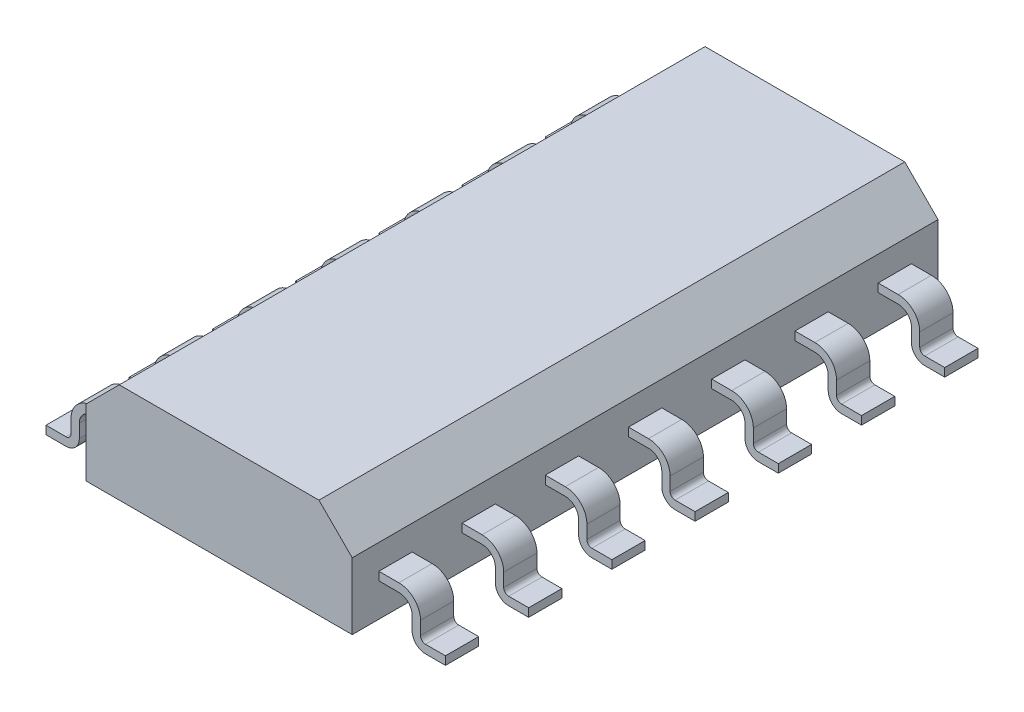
from build123d import *

# Parameters (mm, degrees)
EXTRUDE1_DEPTH       = 4.4
EXTRUDE2_DEPTH       = 0.5
LPATTERN1_COUNT      = 7
LPATTERN1_PITCH      = 1.25
MIRROR1_COPY_1_DEPTH = 0.5
MIRROR1_COPY_2_DEPTH = 0.5
MIRROR1_COPY_3_DEPTH = 0.5
MIRROR1_COPY_4_DEPTH = 0.5
MIRROR1_COPY_5_DEPTH = 0.5
MIRROR1_COPY_6_DEPTH = 0.5


with BuildPart() as part:
    # Sketch1 → Extrude1 (new, symmetric)
    with BuildSketch(Plane.XY):
        Polygon((-2, -0.75), (2, -0.75), (2, 0.25), (1.5, 0.75), (-1.5, 0.75), (-2, 0.25), align=None)
    extrude(amount=EXTRUDE1_DEPTH, both=True)

    # Sketch2 → Extrude2 (add)
    with BuildSketch(Plane.XY.offset(4)):
        with BuildLine():
            Line((-2.5, -0.65), (-2.5, -0.45))
            ThreePointArc((-2.5, -0.45), (-2.441421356, -0.308578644), (-2.3, -0.25))
            Line((-2.3, -0.25), (-2, -0.25))
            Line((-2, -0.25), (-2, -0.125))
            Line((-2, -0.125), (-2.3, -0.125))
            ThreePointArc((-2.3, -0.125), (-2.529809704, -0.220190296), (-2.625, -0.45))
            Line((-2.625, -0.45), (-2.625, -0.65))
            ThreePointArc((-2.625, -0.65), (-2.646966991, -0.703033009), (-2.7, -0.725))
            Line((-2.7, -0.725), (-3, -0.725))
            Line((-3, -0.725), (-3, -0.85))
            Line((-3, -0.85), (-2.7, -0.85))
            ThreePointArc((-2.7, -0.85), (-2.558578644, -0.791421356), (-2.5, -0.65))
        make_face()
    extrude2 = extrude(amount=-EXTRUDE2_DEPTH)

    # LPattern1: Extrude2 ×7
    with Locations(*[(0, 0, -i * LPATTERN1_PITCH) for i in range(1, LPATTERN1_COUNT)]):
        add(extrude2)

    # Mirror1: Extrude2 across plane
    add(extrude2.mirror(Plane(origin=(0, 0, 0), x_dir=(0, 0, 1), z_dir=(1, 0, 0))))

    # Mirror1 copy 1 sketch → Mirror1 copy 1 (add)
    with BuildSketch(Plane(origin=(0, 0, 2.75), x_dir=(-1, 0, 0), z_dir=(0, 0, 1))):
        with BuildLine():
            Line((-2.5, 0.65), (-2.5, 0.45))
            ThreePointArc((-2.5, 0.45), (-2.441421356, 0.308578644), (-2.3, 0.25))
            Line((-2.3, 0.25), (-2, 0.25))
            Line((-2, 0.25), (-2, 0.125))
            Line((-2, 0.125), (-2.3, 0.125))
            ThreePointArc((-2.3, 0.125), (-2.529809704, 0.220190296), (-2.625, 0.45))
            Line((-2.625, 0.45), (-2.625, 0.65))
            ThreePointArc((-2.625, 0.65), (-2.646966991, 0.703033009), (-2.7, 0.725))
            Line((-2.7, 0.725), (-3, 0.725))
            Line((-3, 0.725), (-3, 0.85))
            Line((-3, 0.85), (-2.7, 0.85))
            ThreePointArc((-2.7, 0.85), (-2.558578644, 0.791421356), (-2.5, 0.65))
        make_face()
    extrude(amount=-MIRROR1_COPY_1_DEPTH)

    # Mirror1 copy 2 sketch → Mirror1 copy 2 (add)
    with BuildSketch(Plane(origin=(0, 0, 1.5), x_dir=(-1, 0, 0), z_dir=(0, 0, 1))):
        with BuildLine():
            Line((-2.5, 0.65), (-2.5, 0.45))
            ThreePointArc((-2.5, 0.45), (-2.441421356, 0.308578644), (-2.3, 0.25))
            Line((-2.3, 0.25), (-2, 0.25))
            Line((-2, 0.25), (-2, 0.125))
            Line((-2, 0.125), (-2.3, 0.125))
            ThreePointArc((-2.3, 0.125), (-2.529809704, 0.220190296), (-2.625, 0.45))
            Line((-2.625, 0.45), (-2.625, 0.65))
            ThreePointArc((-2.625, 0.65), (-2.646966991, 0.703033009), (-2.7, 0.725))
            Line((-2.7, 0.725), (-3, 0.725))
            Line((-3, 0.725), (-3, 0.85))
            Line((-3, 0.85), (-2.7, 0.85))
            ThreePointArc((-2.7, 0.85), (-2.558578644, 0.791421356), (-2.5, 0.65))
        make_face()
    extrude(amount=-MIRROR1_COPY_2_DEPTH)

    # Mirror1 copy 3 sketch → Mirror1 copy 3 (add)
    with BuildSketch(Plane(origin=(0, 0, 0.25), x_dir=(-1, 0, 0), z_dir=(0, 0, 1))):
        with BuildLine():
            Line((-2.5, 0.65), (-2.5, 0.45))
            ThreePointArc((-2.5, 0.45), (-2.441421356, 0.308578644), (-2.3, 0.25))
            Line((-2.3, 0.25), (-2, 0.25))
            Line((-2, 0.25), (-2, 0.125))
            Line((-2, 0.125), (-2.3, 0.125))
            ThreePointArc((-2.3, 0.125), (-2.529809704, 0.220190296), (-2.625, 0.45))
            Line((-2.625, 0.45), (-2.625, 0.65))
            ThreePointArc((-2.625, 0.65), (-2.646966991, 0.703033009), (-2.7, 0.725))
            Line((-2.7, 0.725), (-3, 0.725))
            Line((-3, 0.725), (-3, 0.85))
            Line((-3, 0.85), (-2.7, 0.85))
            ThreePointArc((-2.7, 0.85), (-2.558578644, 0.791421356), (-2.5, 0.65))
        make_face()
    extrude(amount=-MIRROR1_COPY_3_DEPTH)

    # Mirror1 copy 4 sketch → Mirror1 copy 4 (add)
    with BuildSketch(Plane(origin=(0, 0, -1), x_dir=(-1, 0, 0), z_dir=(0, 0, 1))):
        with BuildLine():
            Line((-2.5, 0.65), (-2.5, 0.45))
            ThreePointArc((-2.5, 0.45), (-2.441421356, 0.308578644), (-2.3, 0.25))
            Line((-2.3, 0.25), (-2, 0.25))
            Line((-2, 0.25), (-2, 0.125))
            Line((-2, 0.125), (-2.3, 0.125))
            ThreePointArc((-2.3, 0.125), (-2.529809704, 0.220190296), (-2.625, 0.45))
            Line((-2.625, 0.45), (-2.625, 0.65))
            ThreePointArc((-2.625, 0.65), (-2.646966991, 0.703033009), (-2.7, 0.725))
            Line((-2.7, 0.725), (-3, 0.725))
            Line((-3, 0.725), (-3, 0.85))
            Line((-3, 0.85), (-2.7, 0.85))
            ThreePointArc((-2.7, 0.85), (-2.558578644, 0.791421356), (-2.5, 0.65))
        make_face()
    extrude(amount=-MIRROR1_COPY_4_DEPTH)

    # Mirror1 copy 5 sketch → Mirror1 copy 5 (add)
    with BuildSketch(Plane(origin=(0, 0, -2.25), x_dir=(-1, 0, 0), z_dir=(0, 0, 1))):
        with BuildLine():
            Line((-2.5, 0.65), (-2.5, 0.45))
            ThreePointArc((-2.5, 0.45), (-2.441421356, 0.308578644), (-2.3, 0.25))
            Line((-2.3, 0.25), (-2, 0.25))
            Line((-2, 0.25), (-2, 0.125))
            Line((-2, 0.125), (-2.3, 0.125))
            ThreePointArc((-2.3, 0.125), (-2.529809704, 0.220190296), (-2.625, 0.45))
            Line((-2.625, 0.45), (-2.625, 0.65))
            ThreePointArc((-2.625, 0.65), (-2.646966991, 0.703033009), (-2.7, 0.725))
            Line((-2.7, 0.725), (-3, 0.725))
            Line((-3, 0.725), (-3, 0.85))
            Line((-3, 0.85), (-2.7, 0.85))
            ThreePointArc((-2.7, 0.85), (-2.558578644, 0.791421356), (-2.5, 0.65))
        make_face()
    extrude(amount=-MIRROR1_COPY_5_DEPTH)

    # Mirror1 copy 6 sketch → Mirror1 copy 6 (add)
    with BuildSketch(Plane(origin=(0, 0, -3.5), x_dir=(-1, 0, 0), z_dir=(0, 0, 1))):
        with BuildLine():
            Line((-2.5, 0.65), (-2.5, 0.45))
            ThreePointArc((-2.5, 0.45), (-2.441421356, 0.308578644), (-2.3, 0.25))
            Line((-2.3, 0.25), (-2, 0.25))
            Line((-2, 0.25), (-2, 0.125))
            Line((-2, 0.125), (-2.3, 0.125))
            ThreePointArc((-2.3, 0.125), (-2.529809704, 0.220190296), (-2.625, 0.45))
            Line((-2.625, 0.45), (-2.625, 0.65))
            ThreePointArc((-2.625, 0.65), (-2.646966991, 0.703033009), (-2.7, 0.725))
            Line((-2.7, 0.725), (-3, 0.725))
            Line((-3, 0.725), (-3, 0.85))
            Line((-3, 0.85), (-2.7, 0.85))
            ThreePointArc((-2.7, 0.85), (-2.558578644, 0.791421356), (-2.5, 0.65))
        make_face()
    extrude(amount=-MIRROR1_COPY_6_DEPTH)


solid = part.part
